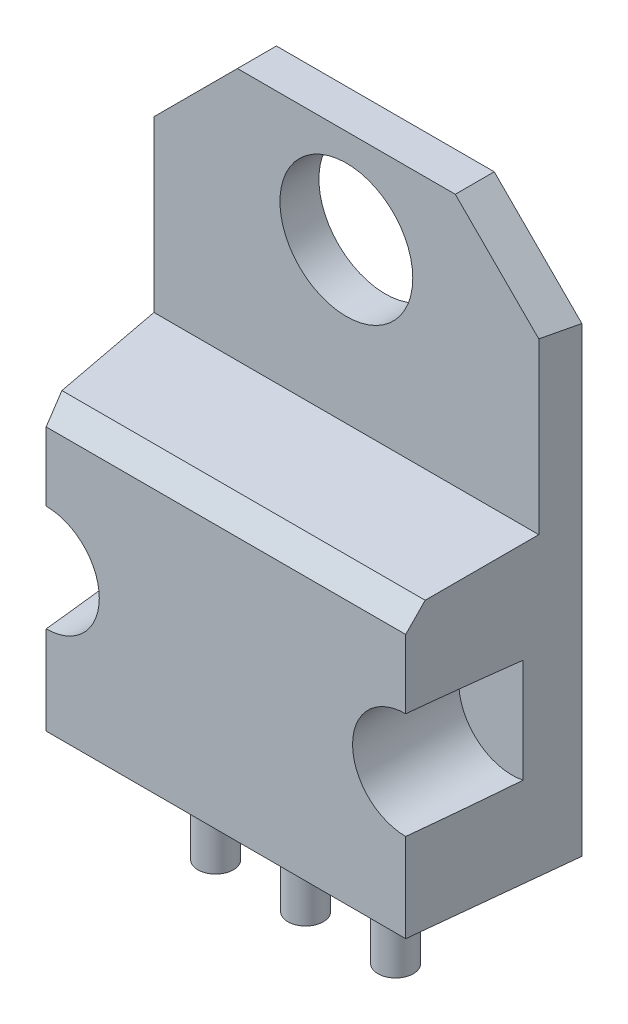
ISO-10303-21;
HEADER;
FILE_DESCRIPTION(('STEP AP214'),'2;1');
FILE_NAME('part.step','',(''),(''),'','','');
FILE_SCHEMA(('AUTOMOTIVE_DESIGN { 1 0 10303 214 1 1 1 1 }'));
ENDSEC;
DATA;
#1=APPLICATION_CONTEXT('core data for automotive mechanical design processes');
#2=APPLICATION_PROTOCOL_DEFINITION('international standard','automotive_design',2000,#1);
#3=PRODUCT_CONTEXT('',#1,'mechanical');
#4=PRODUCT('Part','Part','',(#3));
#5=PRODUCT_RELATED_PRODUCT_CATEGORY('part','',(#4));
#6=PRODUCT_DEFINITION_FORMATION('','',#4);
#7=PRODUCT_DEFINITION_CONTEXT('part definition',#1,'design');
#8=PRODUCT_DEFINITION('design','',#6,#7);
#9=PRODUCT_DEFINITION_SHAPE('','',#8);
#10=(LENGTH_UNIT() NAMED_UNIT(*) SI_UNIT(.MILLI.,.METRE.));
#11=(NAMED_UNIT(*) PLANE_ANGLE_UNIT() SI_UNIT($,.RADIAN.));
#12=(NAMED_UNIT(*) SI_UNIT($,.STERADIAN.) SOLID_ANGLE_UNIT());
#13=UNCERTAINTY_MEASURE_WITH_UNIT(LENGTH_MEASURE(1.E-05),#10,'distance_accuracy_value','');
#14=(GEOMETRIC_REPRESENTATION_CONTEXT(3) GLOBAL_UNCERTAINTY_ASSIGNED_CONTEXT((#13)) GLOBAL_UNIT_ASSIGNED_CONTEXT((#10,
#11,#12)) REPRESENTATION_CONTEXT('',''));
#15=CARTESIAN_POINT('',(0.,0.,0.));
#16=DIRECTION('',(0.,0.,1.));
#17=DIRECTION('',(1.,0.,0.));
#18=AXIS2_PLACEMENT_3D('',#15,#16,#17);
#19=CARTESIAN_POINT('',(0.,0.,1.1));
#20=DIRECTION('',(0.,1.,0.));
#21=DIRECTION('',(0.,0.,1.));
#22=AXIS2_PLACEMENT_3D('',#19,#20,#21);
#23=PLANE('',#22);
#24=CARTESIAN_POINT('',(7.615,0.,2.25));
#25=DIRECTION('',(0.,1.,0.));
#26=DIRECTION('',(0.,0.,1.));
#27=AXIS2_PLACEMENT_3D('',#24,#25,#26);
#28=CIRCLE('',#27,0.500000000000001);
#29=CARTESIAN_POINT('',(7.615,0.,2.75));
#30=VERTEX_POINT('',#29);
#31=EDGE_CURVE('E45',#30,#30,#28,.F.);
#32=ORIENTED_EDGE('',*,*,#31,.F.);
#33=EDGE_LOOP('',(#32));
#34=FACE_BOUND('',#33,.T.);
#35=DIRECTION('',(1.,0.,0.));
#36=VECTOR('',#35,1.);
#37=CARTESIAN_POINT('',(0.,0.,0.));
#38=LINE('',#37,#36);
#39=CARTESIAN_POINT('',(-0.472969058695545,0.,0.));
#40=VERTEX_POINT('',#39);
#41=CARTESIAN_POINT('',(10.6229690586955,0.,0.));
#42=VERTEX_POINT('',#41);
#43=EDGE_CURVE('E175',#40,#42,#38,.T.);
#44=ORIENTED_EDGE('',*,*,#43,.T.);
#45=DIRECTION('',(-0.104528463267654,0.,0.994521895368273));
#46=VECTOR('',#45,1.);
#47=CARTESIAN_POINT('',(10.15,0.,4.5));
#48=LINE('',#47,#46);
#49=CARTESIAN_POINT('',(10.15,0.,4.5));
#50=VERTEX_POINT('',#49);
#51=EDGE_CURVE('E185',#50,#42,#48,.F.);
#52=ORIENTED_EDGE('',*,*,#51,.F.);
#53=DIRECTION('',(1.,0.,0.));
#54=VECTOR('',#53,1.);
#55=CARTESIAN_POINT('',(0.,0.,4.5));
#56=LINE('',#55,#54);
#57=CARTESIAN_POINT('',(0.,0.,4.5));
#58=VERTEX_POINT('',#57);
#59=EDGE_CURVE('E158',#58,#50,#56,.T.);
#60=ORIENTED_EDGE('',*,*,#59,.F.);
#61=DIRECTION('',(0.104528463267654,0.,0.994521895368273));
#62=VECTOR('',#61,1.);
#63=CARTESIAN_POINT('',(-0.353449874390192,0.,1.13714907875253));
#64=LINE('',#63,#62);
#65=EDGE_CURVE('E190',#58,#40,#64,.F.);
#66=ORIENTED_EDGE('',*,*,#65,.T.);
#67=EDGE_LOOP('',(#44,#52,#60,#66));
#68=FACE_BOUND('',#67,.T.);
#69=CARTESIAN_POINT('',(5.075,0.,2.25));
#70=DIRECTION('',(0.,1.,0.));
#71=DIRECTION('',(0.,0.,1.));
#72=AXIS2_PLACEMENT_3D('',#69,#70,#71);
#73=CIRCLE('',#72,0.5);
#74=CARTESIAN_POINT('',(5.075,0.,2.75));
#75=VERTEX_POINT('',#74);
#76=EDGE_CURVE('E246',#75,#75,#73,.F.);
#77=ORIENTED_EDGE('',*,*,#76,.F.);
#78=EDGE_LOOP('',(#77));
#79=FACE_BOUND('',#78,.T.);
#80=CARTESIAN_POINT('',(2.535,0.,2.25));
#81=DIRECTION('',(0.,1.,0.));
#82=DIRECTION('',(0.,0.,1.));
#83=AXIS2_PLACEMENT_3D('',#80,#81,#82);
#84=CIRCLE('',#83,0.5);
#85=CARTESIAN_POINT('',(2.535,0.,2.75));
#86=VERTEX_POINT('',#85);
#87=EDGE_CURVE('E11',#86,#86,#84,.F.);
#88=ORIENTED_EDGE('',*,*,#87,.F.);
#89=EDGE_LOOP('',(#88));
#90=FACE_BOUND('',#89,.T.);
#91=ADVANCED_FACE('F37',(#34,#68,#79,#90),#23,.F.);
#92=CARTESIAN_POINT('',(0.,15.5,1.1));
#93=DIRECTION('',(0.,0.,-1.));
#94=DIRECTION('',(-1.,0.,0.));
#95=AXIS2_PLACEMENT_3D('',#92,#93,#94);
#96=PLANE('',#95);
#97=CARTESIAN_POINT('',(5.075,12.85,1.1));
#98=DIRECTION('',(0.,0.,1.));
#99=DIRECTION('',(1.,0.,0.));
#100=AXIS2_PLACEMENT_3D('',#97,#98,#99);
#101=CIRCLE('',#100,1.875);
#102=CARTESIAN_POINT('',(6.94999999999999,12.85,1.1));
#103=VERTEX_POINT('',#102);
#104=EDGE_CURVE('E168',#103,#103,#101,.T.);
#105=ORIENTED_EDGE('',*,*,#104,.F.);
#106=EDGE_LOOP('',(#105));
#107=FACE_BOUND('',#106,.T.);
#108=DIRECTION('',(1.,0.,0.));
#109=VECTOR('',#108,1.);
#110=CARTESIAN_POINT('',(0.,8.3573543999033,1.1));
#111=LINE('',#110,#109);
#112=CARTESIAN_POINT('',(10.5073543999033,8.3573543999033,1.1));
#113=VERTEX_POINT('',#112);
#114=CARTESIAN_POINT('',(-0.357354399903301,8.3573543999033,1.1));
#115=VERTEX_POINT('',#114);
#116=EDGE_CURVE('E218',#113,#115,#111,.F.);
#117=ORIENTED_EDGE('',*,*,#116,.F.);
#118=DIRECTION('',(0.,-1.,0.));
#119=VECTOR('',#118,1.);
#120=CARTESIAN_POINT('',(10.5073543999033,15.5,1.1));
#121=LINE('',#120,#119);
#122=CARTESIAN_POINT('',(10.5073543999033,13.1426456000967,1.1));
#123=VERTEX_POINT('',#122);
#124=EDGE_CURVE('E186',#113,#123,#121,.F.);
#125=ORIENTED_EDGE('',*,*,#124,.T.);
#126=DIRECTION('',(0.707106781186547,-0.707106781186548,0.));
#127=VECTOR('',#126,1.);
#128=CARTESIAN_POINT('',(8.15,15.5,1.1));
#129=LINE('',#128,#127);
#130=CARTESIAN_POINT('',(8.14999999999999,15.5,1.1));
#131=VERTEX_POINT('',#130);
#132=EDGE_CURVE('E200',#123,#131,#129,.F.);
#133=ORIENTED_EDGE('',*,*,#132,.T.);
#134=DIRECTION('',(-1.,0.,0.));
#135=VECTOR('',#134,1.);
#136=CARTESIAN_POINT('',(0.,15.5,1.1));
#137=LINE('',#136,#135);
#138=CARTESIAN_POINT('',(2.00000000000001,15.5,1.1));
#139=VERTEX_POINT('',#138);
#140=EDGE_CURVE('E182',#131,#139,#137,.T.);
#141=ORIENTED_EDGE('',*,*,#140,.T.);
#142=DIRECTION('',(0.707106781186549,0.707106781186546,0.));
#143=VECTOR('',#142,1.);
#144=CARTESIAN_POINT('',(0.,13.5,1.1));
#145=LINE('',#144,#143);
#146=CARTESIAN_POINT('',(-0.357354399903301,13.1426456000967,1.1));
#147=VERTEX_POINT('',#146);
#148=EDGE_CURVE('E198',#139,#147,#145,.F.);
#149=ORIENTED_EDGE('',*,*,#148,.T.);
#150=DIRECTION('',(0.,1.,0.));
#151=VECTOR('',#150,1.);
#152=CARTESIAN_POINT('',(-0.357354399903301,15.5,1.1));
#153=LINE('',#152,#151);
#154=EDGE_CURVE('E181',#147,#115,#153,.F.);
#155=ORIENTED_EDGE('',*,*,#154,.T.);
#156=EDGE_LOOP('',(#117,#125,#133,#141,#149,#155));
#157=FACE_BOUND('',#156,.T.);
#158=ADVANCED_FACE('F255',(#107,#157),#96,.F.);
#159=CARTESIAN_POINT('',(0.,0.,4.5));
#160=DIRECTION('',(-0.994521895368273,0.,0.104528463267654));
#161=DIRECTION('',(0.104528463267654,0.,0.994521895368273));
#162=AXIS2_PLACEMENT_3D('',#159,#160,#161);
#163=PLANE('',#162);
#164=DIRECTION('',(0.,-1.,0.));
#165=VECTOR('',#164,1.);
#166=CARTESIAN_POINT('',(0.,0.,4.5));
#167=LINE('',#166,#165);
#168=CARTESIAN_POINT('',(0.,7.43819810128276,4.5));
#169=VERTEX_POINT('',#168);
#170=CARTESIAN_POINT('',(0.,5.5,4.5));
#171=VERTEX_POINT('',#170);
#172=EDGE_CURVE('E224',#169,#171,#167,.T.);
#173=ORIENTED_EDGE('',*,*,#172,.F.);
#174=DIRECTION('',(0.066000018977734,-0.775451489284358,0.627948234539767));
#175=VECTOR('',#174,1.);
#176=CARTESIAN_POINT('',(0.,7.43819810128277,4.5));
#177=LINE('',#176,#175);
#178=CARTESIAN_POINT('',(-0.0522642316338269,8.05226423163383,4.00273905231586));
#179=VERTEX_POINT('',#178);
#180=EDGE_CURVE('E60',#169,#179,#177,.F.);
#181=ORIENTED_EDGE('',*,*,#180,.T.);
#182=DIRECTION('',(-0.103962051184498,0.103962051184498,-0.989132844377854));
#183=VECTOR('',#182,1.);
#184=CARTESIAN_POINT('',(0.0864648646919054,7.9135351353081,5.32265823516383));
#185=LINE('',#184,#183);
#186=EDGE_CURVE('E159',#179,#115,#185,.T.);
#187=ORIENTED_EDGE('',*,*,#186,.T.);
#188=ORIENTED_EDGE('',*,*,#154,.F.);
#189=DIRECTION('',(-0.103962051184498,-0.103962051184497,-0.989132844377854));
#190=VECTOR('',#189,1.);
#191=CARTESIAN_POINT('',(-0.349629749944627,13.1503702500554,1.17349513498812));
#192=LINE('',#191,#190);
#193=CARTESIAN_POINT('',(-0.472969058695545,13.0270309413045,0.));
#194=VERTEX_POINT('',#193);
#195=EDGE_CURVE('E201',#147,#194,#192,.T.);
#196=ORIENTED_EDGE('',*,*,#195,.T.);
#197=DIRECTION('',(0.,1.,0.));
#198=VECTOR('',#197,1.);
#199=CARTESIAN_POINT('',(-0.472969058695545,15.5,0.));
#200=LINE('',#199,#198);
#201=EDGE_CURVE('E174',#194,#40,#200,.F.);
#202=ORIENTED_EDGE('',*,*,#201,.T.);
#203=ORIENTED_EDGE('',*,*,#65,.F.);
#204=DIRECTION('',(0.,1.,0.));
#205=VECTOR('',#204,1.);
#206=CARTESIAN_POINT('',(0.,8.,4.5));
#207=LINE('',#206,#205);
#208=CARTESIAN_POINT('',(0.,2.5,4.5));
#209=VERTEX_POINT('',#208);
#210=EDGE_CURVE('E222',#209,#58,#207,.F.);
#211=ORIENTED_EDGE('',*,*,#210,.F.);
#212=CARTESIAN_POINT('',(0.,4.,4.5));
#213=DIRECTION('',(-0.994521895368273,0.,0.104528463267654));
#214=DIRECTION('',(0.104528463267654,0.,0.994521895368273));
#215=AXIS2_PLACEMENT_3D('',#212,#213,#214);
#216=ELLIPSE('',#215,14.3501583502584,1.5);
#217=CARTESIAN_POINT('',(-0.31531270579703,2.53351512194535,1.5));
#218=VERTEX_POINT('',#217);
#219=EDGE_CURVE('E205',#209,#218,#216,.F.);
#220=ORIENTED_EDGE('',*,*,#219,.T.);
#221=DIRECTION('',(0.,1.,0.));
#222=VECTOR('',#221,1.);
#223=CARTESIAN_POINT('',(-0.31531270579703,0.,1.5));
#224=LINE('',#223,#222);
#225=CARTESIAN_POINT('',(-0.31531270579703,5.46648487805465,1.5));
#226=VERTEX_POINT('',#225);
#227=EDGE_CURVE('E209',#226,#218,#224,.F.);
#228=ORIENTED_EDGE('',*,*,#227,.F.);
#229=CARTESIAN_POINT('',(0.,4.,4.5));
#230=DIRECTION('',(-0.994521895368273,0.,0.104528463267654));
#231=DIRECTION('',(0.104528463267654,0.,0.994521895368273));
#232=AXIS2_PLACEMENT_3D('',#229,#230,#231);
#233=ELLIPSE('',#232,14.3501583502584,1.5);
#234=EDGE_CURVE('E215',#226,#171,#233,.F.);
#235=ORIENTED_EDGE('',*,*,#234,.T.);
#236=EDGE_LOOP('',(#173,#181,#187,#188,#196,#202,#203,#211,#220,#228,#235));
#237=FACE_BOUND('',#236,.T.);
#238=ADVANCED_FACE('F39',(#237),#163,.T.);
#239=CARTESIAN_POINT('',(10.15,0.,4.5));
#240=DIRECTION('',(0.994521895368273,0.,0.104528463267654));
#241=DIRECTION('',(0.104528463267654,0.,-0.994521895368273));
#242=AXIS2_PLACEMENT_3D('',#239,#240,#241);
#243=PLANE('',#242);
#244=DIRECTION('',(0.103962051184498,0.103962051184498,-0.989132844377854));
#245=VECTOR('',#244,1.);
#246=CARTESIAN_POINT('',(10.0402977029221,7.89029770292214,5.54374763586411));
#247=LINE('',#246,#245);
#248=CARTESIAN_POINT('',(10.2022642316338,8.05226423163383,4.00273905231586));
#249=VERTEX_POINT('',#248);
#250=EDGE_CURVE('E162',#249,#113,#247,.T.);
#251=ORIENTED_EDGE('',*,*,#250,.F.);
#252=DIRECTION('',(0.0660000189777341,0.775451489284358,-0.627948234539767));
#253=VECTOR('',#252,1.);
#254=CARTESIAN_POINT('',(10.1057865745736,6.9187229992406,4.92066264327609));
#255=LINE('',#254,#253);
#256=CARTESIAN_POINT('',(10.15,7.43819810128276,4.5));
#257=VERTEX_POINT('',#256);
#258=EDGE_CURVE('E244',#249,#257,#255,.F.);
#259=ORIENTED_EDGE('',*,*,#258,.T.);
#260=DIRECTION('',(0.,-1.,0.));
#261=VECTOR('',#260,1.);
#262=CARTESIAN_POINT('',(10.15,8.,4.5));
#263=LINE('',#262,#261);
#264=CARTESIAN_POINT('',(10.15,5.5,4.5));
#265=VERTEX_POINT('',#264);
#266=EDGE_CURVE('E160',#265,#257,#263,.F.);
#267=ORIENTED_EDGE('',*,*,#266,.F.);
#268=CARTESIAN_POINT('',(10.15,4.,4.49999999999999));
#269=DIRECTION('',(0.994521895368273,0.,0.104528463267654));
#270=DIRECTION('',(-0.104528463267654,0.,0.994521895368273));
#271=AXIS2_PLACEMENT_3D('',#268,#269,#270);
#272=ELLIPSE('',#271,14.3501583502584,1.5);
#273=CARTESIAN_POINT('',(10.465312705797,5.46648487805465,1.5));
#274=VERTEX_POINT('',#273);
#275=EDGE_CURVE('E138',#265,#274,#272,.F.);
#276=ORIENTED_EDGE('',*,*,#275,.T.);
#277=DIRECTION('',(0.,-1.,0.));
#278=VECTOR('',#277,1.);
#279=CARTESIAN_POINT('',(10.465312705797,0.,1.5));
#280=LINE('',#279,#278);
#281=CARTESIAN_POINT('',(10.465312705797,2.53351512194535,1.5));
#282=VERTEX_POINT('',#281);
#283=EDGE_CURVE('E152',#282,#274,#280,.F.);
#284=ORIENTED_EDGE('',*,*,#283,.F.);
#285=CARTESIAN_POINT('',(10.15,4.,4.49999999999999));
#286=DIRECTION('',(0.994521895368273,0.,0.104528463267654));
#287=DIRECTION('',(-0.104528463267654,0.,0.994521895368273));
#288=AXIS2_PLACEMENT_3D('',#285,#286,#287);
#289=ELLIPSE('',#288,14.3501583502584,1.5);
#290=CARTESIAN_POINT('',(10.15,2.5,4.5));
#291=VERTEX_POINT('',#290);
#292=EDGE_CURVE('E135',#282,#291,#289,.F.);
#293=ORIENTED_EDGE('',*,*,#292,.T.);
#294=DIRECTION('',(0.,1.,0.));
#295=VECTOR('',#294,1.);
#296=CARTESIAN_POINT('',(10.15,0.,4.5));
#297=LINE('',#296,#295);
#298=EDGE_CURVE('E151',#50,#291,#297,.T.);
#299=ORIENTED_EDGE('',*,*,#298,.F.);
#300=ORIENTED_EDGE('',*,*,#51,.T.);
#301=DIRECTION('',(0.,-1.,0.));
#302=VECTOR('',#301,1.);
#303=CARTESIAN_POINT('',(10.6229690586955,15.5,0.));
#304=LINE('',#303,#302);
#305=CARTESIAN_POINT('',(10.6229690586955,13.0270309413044,0.));
#306=VERTEX_POINT('',#305);
#307=EDGE_CURVE('E177',#42,#306,#304,.F.);
#308=ORIENTED_EDGE('',*,*,#307,.T.);
#309=DIRECTION('',(-0.103962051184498,0.103962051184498,0.989132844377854));
#310=VECTOR('',#309,1.);
#311=CARTESIAN_POINT('',(10.4563973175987,13.1936026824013,1.58482425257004));
#312=LINE('',#311,#310);
#313=EDGE_CURVE('E197',#306,#123,#312,.T.);
#314=ORIENTED_EDGE('',*,*,#313,.T.);
#315=ORIENTED_EDGE('',*,*,#124,.F.);
#316=EDGE_LOOP('',(#251,#259,#267,#276,#284,#293,#299,#300,#308,#314,#315));
#317=FACE_BOUND('',#316,.T.);
#318=ADVANCED_FACE('F149',(#317),#243,.T.);
#319=CARTESIAN_POINT('',(0.,15.5,1.1));
#320=DIRECTION('',(0.,-1.,0.));
#321=DIRECTION('',(0.,0.,-1.));
#322=AXIS2_PLACEMENT_3D('',#319,#320,#321);
#323=PLANE('',#322);
#324=ORIENTED_EDGE('',*,*,#140,.F.);
#325=DIRECTION('',(0.,0.,-1.));
#326=VECTOR('',#325,1.);
#327=CARTESIAN_POINT('',(8.15,15.5,1.1));
#328=LINE('',#327,#326);
#329=CARTESIAN_POINT('',(8.15,15.5,0.));
#330=VERTEX_POINT('',#329);
#331=EDGE_CURVE('E189',#131,#330,#328,.T.);
#332=ORIENTED_EDGE('',*,*,#331,.T.);
#333=DIRECTION('',(-1.,0.,0.));
#334=VECTOR('',#333,1.);
#335=CARTESIAN_POINT('',(0.,15.5,0.));
#336=LINE('',#335,#334);
#337=CARTESIAN_POINT('',(2.00000000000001,15.5,0.));
#338=VERTEX_POINT('',#337);
#339=EDGE_CURVE('E178',#330,#338,#336,.T.);
#340=ORIENTED_EDGE('',*,*,#339,.T.);
#341=DIRECTION('',(0.,0.,1.));
#342=VECTOR('',#341,1.);
#343=CARTESIAN_POINT('',(2.00000000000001,15.5,1.1));
#344=LINE('',#343,#342);
#345=EDGE_CURVE('E187',#338,#139,#344,.T.);
#346=ORIENTED_EDGE('',*,*,#345,.T.);
#347=EDGE_LOOP('',(#324,#332,#340,#346));
#348=FACE_BOUND('',#347,.T.);
#349=ADVANCED_FACE('F326',(#348),#323,.F.);
#350=CARTESIAN_POINT('',(0.,15.5,0.));
#351=DIRECTION('',(0.,0.,-1.));
#352=DIRECTION('',(-1.,0.,0.));
#353=AXIS2_PLACEMENT_3D('',#350,#351,#352);
#354=PLANE('',#353);
#355=CARTESIAN_POINT('',(5.075,12.85,0.));
#356=DIRECTION('',(0.,0.,1.));
#357=DIRECTION('',(1.,0.,0.));
#358=AXIS2_PLACEMENT_3D('',#355,#356,#357);
#359=CIRCLE('',#358,1.875);
#360=CARTESIAN_POINT('',(6.94999999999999,12.85,0.));
#361=VERTEX_POINT('',#360);
#362=EDGE_CURVE('E171',#361,#361,#359,.T.);
#363=ORIENTED_EDGE('',*,*,#362,.T.);
#364=EDGE_LOOP('',(#363));
#365=FACE_BOUND('',#364,.T.);
#366=ORIENTED_EDGE('',*,*,#339,.F.);
#367=DIRECTION('',(-0.707106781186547,0.707106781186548,0.));
#368=VECTOR('',#367,1.);
#369=CARTESIAN_POINT('',(4.07500000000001,19.575,0.));
#370=LINE('',#369,#368);
#371=EDGE_CURVE('E195',#330,#306,#370,.F.);
#372=ORIENTED_EDGE('',*,*,#371,.T.);
#373=ORIENTED_EDGE('',*,*,#307,.F.);
#374=ORIENTED_EDGE('',*,*,#43,.F.);
#375=ORIENTED_EDGE('',*,*,#201,.F.);
#376=DIRECTION('',(-0.707106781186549,-0.707106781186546,0.));
#377=VECTOR('',#376,1.);
#378=CARTESIAN_POINT('',(0.999999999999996,14.5,0.));
#379=LINE('',#378,#377);
#380=EDGE_CURVE('E193',#194,#338,#379,.F.);
#381=ORIENTED_EDGE('',*,*,#380,.T.);
#382=EDGE_LOOP('',(#366,#372,#373,#374,#375,#381));
#383=FACE_BOUND('',#382,.T.);
#384=ADVANCED_FACE('F322',(#365,#383),#354,.T.);
#385=CARTESIAN_POINT('',(5.075,12.85,0.));
#386=DIRECTION('',(0.,0.,1.));
#387=DIRECTION('',(1.,0.,0.));
#388=AXIS2_PLACEMENT_3D('',#385,#386,#387);
#389=CYLINDRICAL_SURFACE('',#388,1.875);
#390=ORIENTED_EDGE('',*,*,#362,.F.);
#391=EDGE_LOOP('',(#390));
#392=FACE_BOUND('',#391,.T.);
#393=ORIENTED_EDGE('',*,*,#104,.T.);
#394=EDGE_LOOP('',(#393));
#395=FACE_BOUND('',#394,.T.);
#396=ADVANCED_FACE('F318',(#392,#395),#389,.F.);
#397=CARTESIAN_POINT('',(8.15,15.5,1.1));
#398=DIRECTION('',(-0.707106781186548,-0.707106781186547,0.));
#399=DIRECTION('',(0.707106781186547,-0.707106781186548,0.));
#400=AXIS2_PLACEMENT_3D('',#397,#398,#399);
#401=PLANE('',#400);
#402=ORIENTED_EDGE('',*,*,#132,.F.);
#403=ORIENTED_EDGE('',*,*,#313,.F.);
#404=ORIENTED_EDGE('',*,*,#371,.F.);
#405=ORIENTED_EDGE('',*,*,#331,.F.);
#406=EDGE_LOOP('',(#402,#403,#404,#405));
#407=FACE_BOUND('',#406,.T.);
#408=ADVANCED_FACE('F314',(#407),#401,.F.);
#409=CARTESIAN_POINT('',(0.,13.5,1.1));
#410=DIRECTION('',(0.707106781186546,-0.707106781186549,0.));
#411=DIRECTION('',(0.707106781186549,0.707106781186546,0.));
#412=AXIS2_PLACEMENT_3D('',#409,#410,#411);
#413=PLANE('',#412);
#414=ORIENTED_EDGE('',*,*,#148,.F.);
#415=ORIENTED_EDGE('',*,*,#345,.F.);
#416=ORIENTED_EDGE('',*,*,#380,.F.);
#417=ORIENTED_EDGE('',*,*,#195,.F.);
#418=EDGE_LOOP('',(#414,#415,#416,#417));
#419=FACE_BOUND('',#418,.T.);
#420=ADVANCED_FACE('F311',(#419),#413,.F.);
#421=CARTESIAN_POINT('',(0.,8.,4.5));
#422=DIRECTION('',(0.,0.994521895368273,0.104528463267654));
#423=DIRECTION('',(0.,-0.104528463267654,0.994521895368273));
#424=AXIS2_PLACEMENT_3D('',#421,#422,#423);
#425=PLANE('',#424);
#426=ORIENTED_EDGE('',*,*,#186,.F.);
#427=DIRECTION('',(-1.,0.,0.));
#428=VECTOR('',#427,1.);
#429=CARTESIAN_POINT('',(0.,8.05226423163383,4.00273905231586));
#430=LINE('',#429,#428);
#431=EDGE_CURVE('E52',#179,#249,#430,.F.);
#432=ORIENTED_EDGE('',*,*,#431,.T.);
#433=ORIENTED_EDGE('',*,*,#250,.T.);
#434=ORIENTED_EDGE('',*,*,#116,.T.);
#435=EDGE_LOOP('',(#426,#432,#433,#434));
#436=FACE_BOUND('',#435,.T.);
#437=ADVANCED_FACE('F310',(#436),#425,.T.);
#438=CARTESIAN_POINT('',(0.,8.,4.5));
#439=DIRECTION('',(0.,0.,-1.));
#440=DIRECTION('',(-1.,0.,0.));
#441=AXIS2_PLACEMENT_3D('',#438,#439,#440);
#442=PLANE('',#441);
#443=ORIENTED_EDGE('',*,*,#266,.T.);
#444=DIRECTION('',(-1.,0.,0.));
#445=VECTOR('',#444,1.);
#446=CARTESIAN_POINT('',(0.,7.43819810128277,4.5));
#447=LINE('',#446,#445);
#448=EDGE_CURVE('E213',#257,#169,#447,.T.);
#449=ORIENTED_EDGE('',*,*,#448,.T.);
#450=ORIENTED_EDGE('',*,*,#172,.T.);
#451=CARTESIAN_POINT('',(0.,4.,4.5));
#452=DIRECTION('',(0.,0.,-1.));
#453=DIRECTION('',(-1.,0.,0.));
#454=AXIS2_PLACEMENT_3D('',#451,#452,#453);
#455=CIRCLE('',#454,1.5);
#456=EDGE_CURVE('E206',#171,#209,#455,.T.);
#457=ORIENTED_EDGE('',*,*,#456,.T.);
#458=ORIENTED_EDGE('',*,*,#210,.T.);
#459=ORIENTED_EDGE('',*,*,#59,.T.);
#460=ORIENTED_EDGE('',*,*,#298,.T.);
#461=CARTESIAN_POINT('',(10.15,4.,4.5));
#462=DIRECTION('',(0.,0.,1.));
#463=DIRECTION('',(1.,0.,0.));
#464=AXIS2_PLACEMENT_3D('',#461,#462,#463);
#465=CIRCLE('',#464,1.5);
#466=EDGE_CURVE('E131',#265,#291,#465,.T.);
#467=ORIENTED_EDGE('',*,*,#466,.F.);
#468=EDGE_LOOP('',(#443,#449,#450,#457,#458,#459,#460,#467));
#469=FACE_BOUND('',#468,.T.);
#470=ADVANCED_FACE('F156',(#469),#442,.F.);
#471=CARTESIAN_POINT('',(0.,4.,1.5));
#472=DIRECTION('',(0.,0.,1.));
#473=DIRECTION('',(1.,0.,0.));
#474=AXIS2_PLACEMENT_3D('',#471,#472,#473);
#475=PLANE('',#474);
#476=ORIENTED_EDGE('',*,*,#227,.T.);
#477=CARTESIAN_POINT('',(0.,4.,1.5));
#478=DIRECTION('',(0.,0.,1.));
#479=DIRECTION('',(1.,0.,0.));
#480=AXIS2_PLACEMENT_3D('',#477,#478,#479);
#481=CIRCLE('',#480,1.5);
#482=EDGE_CURVE('E153',#218,#226,#481,.T.);
#483=ORIENTED_EDGE('',*,*,#482,.T.);
#484=EDGE_LOOP('',(#476,#483));
#485=FACE_BOUND('',#484,.T.);
#486=ADVANCED_FACE('F301',(#485),#475,.T.);
#487=CARTESIAN_POINT('',(0.,4.,1.5));
#488=DIRECTION('',(0.,0.,1.));
#489=DIRECTION('',(1.,0.,0.));
#490=AXIS2_PLACEMENT_3D('',#487,#488,#489);
#491=CYLINDRICAL_SURFACE('',#490,1.5);
#492=ORIENTED_EDGE('',*,*,#482,.F.);
#493=ORIENTED_EDGE('',*,*,#219,.F.);
#494=ORIENTED_EDGE('',*,*,#456,.F.);
#495=ORIENTED_EDGE('',*,*,#234,.F.);
#496=EDGE_LOOP('',(#492,#493,#494,#495));
#497=FACE_BOUND('',#496,.T.);
#498=ADVANCED_FACE('F297',(#497),#491,.F.);
#499=CARTESIAN_POINT('',(10.15,4.,1.5));
#500=DIRECTION('',(0.,0.,1.));
#501=DIRECTION('',(1.,0.,0.));
#502=AXIS2_PLACEMENT_3D('',#499,#500,#501);
#503=PLANE('',#502);
#504=ORIENTED_EDGE('',*,*,#283,.T.);
#505=CARTESIAN_POINT('',(10.15,4.,1.5));
#506=DIRECTION('',(0.,0.,1.));
#507=DIRECTION('',(1.,0.,0.));
#508=AXIS2_PLACEMENT_3D('',#505,#506,#507);
#509=CIRCLE('',#508,1.5);
#510=EDGE_CURVE('E143',#274,#282,#509,.T.);
#511=ORIENTED_EDGE('',*,*,#510,.T.);
#512=EDGE_LOOP('',(#504,#511));
#513=FACE_BOUND('',#512,.T.);
#514=ADVANCED_FACE('F294',(#513),#503,.T.);
#515=CARTESIAN_POINT('',(10.15,4.,1.5));
#516=DIRECTION('',(0.,0.,1.));
#517=DIRECTION('',(1.,0.,0.));
#518=AXIS2_PLACEMENT_3D('',#515,#516,#517);
#519=CYLINDRICAL_SURFACE('',#518,1.5);
#520=ORIENTED_EDGE('',*,*,#510,.F.);
#521=ORIENTED_EDGE('',*,*,#275,.F.);
#522=ORIENTED_EDGE('',*,*,#466,.T.);
#523=ORIENTED_EDGE('',*,*,#292,.F.);
#524=EDGE_LOOP('',(#520,#521,#522,#523));
#525=FACE_BOUND('',#524,.T.);
#526=ADVANCED_FACE('F134',(#525),#519,.F.);
#527=CARTESIAN_POINT('',(0.,7.43819810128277,4.5));
#528=DIRECTION('',(0.,0.62932039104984,0.777145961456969));
#529=DIRECTION('',(0.,-0.777145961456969,0.62932039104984));
#530=AXIS2_PLACEMENT_3D('',#527,#528,#529);
#531=PLANE('',#530);
#532=ORIENTED_EDGE('',*,*,#258,.F.);
#533=ORIENTED_EDGE('',*,*,#431,.F.);
#534=ORIENTED_EDGE('',*,*,#180,.F.);
#535=ORIENTED_EDGE('',*,*,#448,.F.);
#536=EDGE_LOOP('',(#532,#533,#534,#535));
#537=FACE_BOUND('',#536,.T.);
#538=ADVANCED_FACE('F289',(#537),#531,.T.);
#539=CARTESIAN_POINT('',(5.075,-3.,2.25));
#540=DIRECTION('',(0.,1.,0.));
#541=DIRECTION('',(0.,0.,1.));
#542=AXIS2_PLACEMENT_3D('',#539,#540,#541);
#543=CYLINDRICAL_SURFACE('',#542,0.5);
#544=CARTESIAN_POINT('',(5.075,-3.,2.25));
#545=DIRECTION('',(0.,-1.,0.));
#546=DIRECTION('',(0.,0.,-1.));
#547=AXIS2_PLACEMENT_3D('',#544,#545,#546);
#548=CIRCLE('',#547,0.5);
#549=CARTESIAN_POINT('',(5.075,-3.,1.75));
#550=VERTEX_POINT('',#549);
#551=EDGE_CURVE('E144',#550,#550,#548,.T.);
#552=ORIENTED_EDGE('',*,*,#551,.F.);
#553=EDGE_LOOP('',(#552));
#554=FACE_BOUND('',#553,.T.);
#555=ORIENTED_EDGE('',*,*,#76,.T.);
#556=EDGE_LOOP('',(#555));
#557=FACE_BOUND('',#556,.T.);
#558=ADVANCED_FACE('F285',(#554,#557),#543,.T.);
#559=CARTESIAN_POINT('',(5.075,-3.,2.25));
#560=DIRECTION('',(0.,-1.,0.));
#561=DIRECTION('',(0.,0.,-1.));
#562=AXIS2_PLACEMENT_3D('',#559,#560,#561);
#563=PLANE('',#562);
#564=ORIENTED_EDGE('',*,*,#551,.T.);
#565=EDGE_LOOP('',(#564));
#566=FACE_BOUND('',#565,.T.);
#567=ADVANCED_FACE('F281',(#566),#563,.T.);
#568=CARTESIAN_POINT('',(7.615,-3.,2.25));
#569=DIRECTION('',(0.,1.,0.));
#570=DIRECTION('',(0.,0.,1.));
#571=AXIS2_PLACEMENT_3D('',#568,#569,#570);
#572=CYLINDRICAL_SURFACE('',#571,0.500000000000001);
#573=CARTESIAN_POINT('',(7.615,-3.,2.25));
#574=DIRECTION('',(0.,-1.,0.));
#575=DIRECTION('',(0.,0.,-1.));
#576=AXIS2_PLACEMENT_3D('',#573,#574,#575);
#577=CIRCLE('',#576,0.500000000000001);
#578=CARTESIAN_POINT('',(7.615,-3.,1.75));
#579=VERTEX_POINT('',#578);
#580=EDGE_CURVE('E348',#579,#579,#577,.T.);
#581=ORIENTED_EDGE('',*,*,#580,.F.);
#582=EDGE_LOOP('',(#581));
#583=FACE_BOUND('',#582,.T.);
#584=ORIENTED_EDGE('',*,*,#31,.T.);
#585=EDGE_LOOP('',(#584));
#586=FACE_BOUND('',#585,.T.);
#587=ADVANCED_FACE('F251',(#583,#586),#572,.T.);
#588=CARTESIAN_POINT('',(7.615,-3.,2.25));
#589=DIRECTION('',(0.,-1.,0.));
#590=DIRECTION('',(0.,0.,-1.));
#591=AXIS2_PLACEMENT_3D('',#588,#589,#590);
#592=PLANE('',#591);
#593=ORIENTED_EDGE('',*,*,#580,.T.);
#594=EDGE_LOOP('',(#593));
#595=FACE_BOUND('',#594,.T.);
#596=ADVANCED_FACE('F266',(#595),#592,.T.);
#597=CARTESIAN_POINT('',(2.535,-3.,2.25));
#598=DIRECTION('',(0.,1.,0.));
#599=DIRECTION('',(0.,0.,1.));
#600=AXIS2_PLACEMENT_3D('',#597,#598,#599);
#601=CYLINDRICAL_SURFACE('',#600,0.5);
#602=CARTESIAN_POINT('',(2.535,-3.,2.25));
#603=DIRECTION('',(0.,-1.,0.));
#604=DIRECTION('',(0.,0.,-1.));
#605=AXIS2_PLACEMENT_3D('',#602,#603,#604);
#606=CIRCLE('',#605,0.5);
#607=CARTESIAN_POINT('',(2.535,-3.,1.75));
#608=VERTEX_POINT('',#607);
#609=EDGE_CURVE('E351',#608,#608,#606,.T.);
#610=ORIENTED_EDGE('',*,*,#609,.F.);
#611=EDGE_LOOP('',(#610));
#612=FACE_BOUND('',#611,.T.);
#613=ORIENTED_EDGE('',*,*,#87,.T.);
#614=EDGE_LOOP('',(#613));
#615=FACE_BOUND('',#614,.T.);
#616=ADVANCED_FACE('F263',(#612,#615),#601,.T.);
#617=CARTESIAN_POINT('',(2.535,-3.,2.25));
#618=DIRECTION('',(0.,-1.,0.));
#619=DIRECTION('',(0.,0.,-1.));
#620=AXIS2_PLACEMENT_3D('',#617,#618,#619);
#621=PLANE('',#620);
#622=ORIENTED_EDGE('',*,*,#609,.T.);
#623=EDGE_LOOP('',(#622));
#624=FACE_BOUND('',#623,.T.);
#625=ADVANCED_FACE('F265',(#624),#621,.T.);
#626=CLOSED_SHELL('',(#91,#158,#238,#318,#349,#384,#396,#408,#420,#437,#470,#486,#498,#514,#526,
#538,#558,#567,#587,#596,#616,#625));
#627=MANIFOLD_SOLID_BREP('B2',#626);
#628=ADVANCED_BREP_SHAPE_REPRESENTATION('',(#18,#627),#14);
#629=SHAPE_DEFINITION_REPRESENTATION(#9,#628);
ENDSEC;
END-ISO-10303-21;
